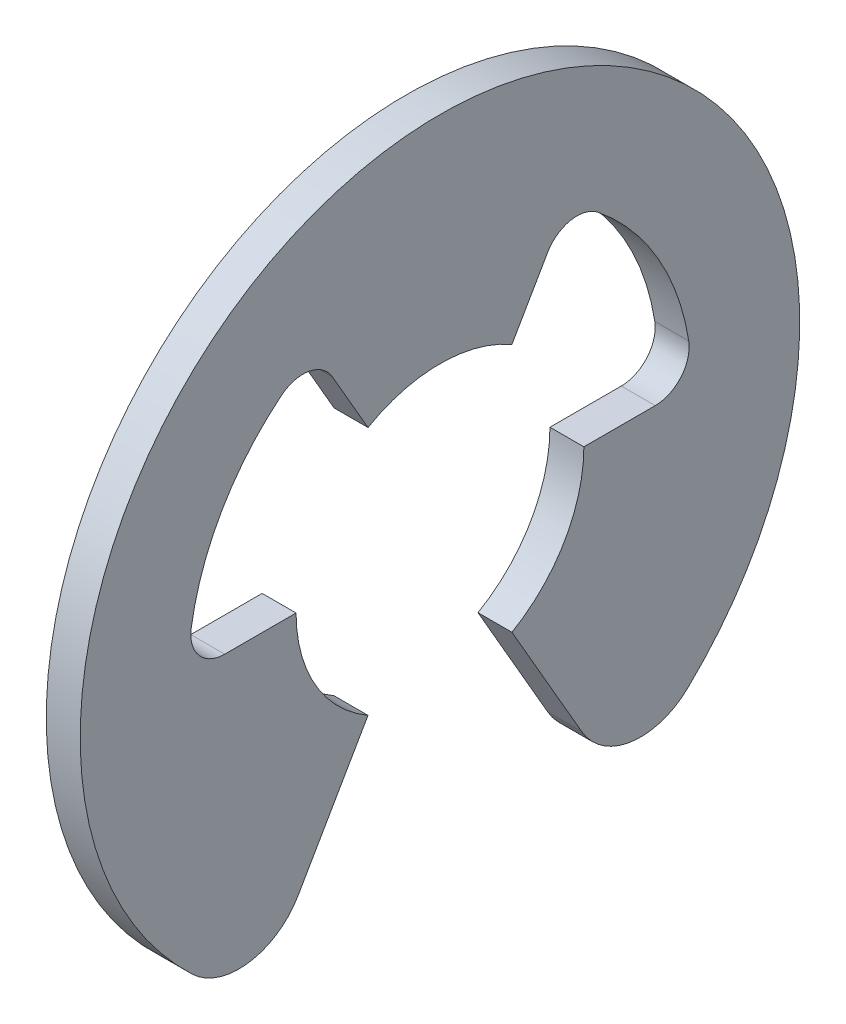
ISO-10303-21;
HEADER;
FILE_DESCRIPTION(('STEP AP214'),'2;1');
FILE_NAME('part.step','',(''),(''),'','','');
FILE_SCHEMA(('AUTOMOTIVE_DESIGN { 1 0 10303 214 1 1 1 1 }'));
ENDSEC;
DATA;
#1=APPLICATION_CONTEXT('core data for automotive mechanical design processes');
#2=APPLICATION_PROTOCOL_DEFINITION('international standard','automotive_design',2000,#1);
#3=PRODUCT_CONTEXT('',#1,'mechanical');
#4=PRODUCT('Part','Part','',(#3));
#5=PRODUCT_RELATED_PRODUCT_CATEGORY('part','',(#4));
#6=PRODUCT_DEFINITION_FORMATION('','',#4);
#7=PRODUCT_DEFINITION_CONTEXT('part definition',#1,'design');
#8=PRODUCT_DEFINITION('design','',#6,#7);
#9=PRODUCT_DEFINITION_SHAPE('','',#8);
#10=(LENGTH_UNIT() NAMED_UNIT(*) SI_UNIT(.MILLI.,.METRE.));
#11=(NAMED_UNIT(*) PLANE_ANGLE_UNIT() SI_UNIT($,.RADIAN.));
#12=(NAMED_UNIT(*) SI_UNIT($,.STERADIAN.) SOLID_ANGLE_UNIT());
#13=UNCERTAINTY_MEASURE_WITH_UNIT(LENGTH_MEASURE(1.E-05),#10,'distance_accuracy_value','');
#14=(GEOMETRIC_REPRESENTATION_CONTEXT(3) GLOBAL_UNCERTAINTY_ASSIGNED_CONTEXT((#13)) GLOBAL_UNIT_ASSIGNED_CONTEXT((#10,
#11,#12)) REPRESENTATION_CONTEXT('',''));
#15=CARTESIAN_POINT('',(0.,0.,0.));
#16=DIRECTION('',(0.,0.,1.));
#17=DIRECTION('',(1.,0.,0.));
#18=AXIS2_PLACEMENT_3D('',#15,#16,#17);
#19=CARTESIAN_POINT('',(-0.3175,-3.96469735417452,-3.75548876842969));
#20=DIRECTION('',(1.,0.,0.));
#21=DIRECTION('',(0.,0.,-1.));
#22=AXIS2_PLACEMENT_3D('',#19,#20,#21);
#23=PLANE('',#22);
#24=DIRECTION('',(0.,0.866025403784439,0.5));
#25=VECTOR('',#24,1.);
#26=CARTESIAN_POINT('',(-0.3175,-2.33168679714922,-1.3462));
#27=LINE('',#26,#25);
#28=CARTESIAN_POINT('',(-0.3175,-4.59969735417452,-2.65563650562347));
#29=VERTEX_POINT('',#28);
#30=CARTESIAN_POINT('',(-0.3175,-2.33168679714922,-1.3462));
#31=VERTEX_POINT('',#30);
#32=EDGE_CURVE('E142',#29,#31,#27,.T.);
#33=ORIENTED_EDGE('',*,*,#32,.T.);
#34=CARTESIAN_POINT('',(-0.3175,0.,0.));
#35=DIRECTION('',(1.,0.,0.));
#36=DIRECTION('',(0.,0.,-1.));
#37=AXIS2_PLACEMENT_3D('',#34,#35,#36);
#38=CIRCLE('',#37,2.6924);
#39=CARTESIAN_POINT('',(-0.3175,0.,-2.6924));
#40=VERTEX_POINT('',#39);
#41=EDGE_CURVE('E223',#31,#40,#38,.T.);
#42=ORIENTED_EDGE('',*,*,#41,.T.);
#43=DIRECTION('',(0.,0.,-1.));
#44=VECTOR('',#43,1.);
#45=CARTESIAN_POINT('',(-0.3175,0.,-4.0269415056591));
#46=LINE('',#45,#44);
#47=CARTESIAN_POINT('',(-0.3175,0.,-4.0269415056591));
#48=VERTEX_POINT('',#47);
#49=EDGE_CURVE('E162',#40,#48,#46,.T.);
#50=ORIENTED_EDGE('',*,*,#49,.T.);
#51=CARTESIAN_POINT('',(-0.3175,0.635,-4.0269415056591));
#52=DIRECTION('',(1.,0.,0.));
#53=DIRECTION('',(0.,0.,-1.));
#54=AXIS2_PLACEMENT_3D('',#51,#52,#53);
#55=CIRCLE('',#54,0.635);
#56=CARTESIAN_POINT('',(-0.3175,0.733909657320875,-4.65419096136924));
#57=VERTEX_POINT('',#56);
#58=EDGE_CURVE('E225',#48,#57,#55,.T.);
#59=ORIENTED_EDGE('',*,*,#58,.T.);
#60=CARTESIAN_POINT('',(-0.3175,0.,0.));
#61=DIRECTION('',(1.,0.,0.));
#62=DIRECTION('',(0.,0.,-1.));
#63=AXIS2_PLACEMENT_3D('',#60,#61,#62);
#64=CIRCLE('',#63,4.71170000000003);
#65=CARTESIAN_POINT('',(-0.3175,3.66369277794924,-2.96267988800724));
#66=VERTEX_POINT('',#65);
#67=EDGE_CURVE('E229',#57,#66,#64,.T.);
#68=ORIENTED_EDGE('',*,*,#67,.T.);
#69=CARTESIAN_POINT('',(-0.3175,3.16993364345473,-2.56339688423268));
#70=DIRECTION('',(1.,0.,0.));
#71=DIRECTION('',(0.,0.,-1.));
#72=AXIS2_PLACEMENT_3D('',#69,#70,#71);
#73=CIRCLE('',#72,0.635);
#74=CARTESIAN_POINT('',(-0.3175,3.48743364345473,-2.01347075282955));
#75=VERTEX_POINT('',#74);
#76=EDGE_CURVE('E233',#66,#75,#73,.T.);
#77=ORIENTED_EDGE('',*,*,#76,.T.);
#78=DIRECTION('',(0.,-0.866025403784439,0.5));
#79=VECTOR('',#78,1.);
#80=CARTESIAN_POINT('',(-0.3175,2.33168679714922,-1.3462));
#81=LINE('',#80,#79);
#82=CARTESIAN_POINT('',(-0.3175,2.33168679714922,-1.3462));
#83=VERTEX_POINT('',#82);
#84=EDGE_CURVE('E167',#75,#83,#81,.T.);
#85=ORIENTED_EDGE('',*,*,#84,.T.);
#86=CARTESIAN_POINT('',(-0.3175,0.,0.));
#87=DIRECTION('',(1.,0.,0.));
#88=DIRECTION('',(0.,0.,-1.));
#89=AXIS2_PLACEMENT_3D('',#86,#87,#88);
#90=CIRCLE('',#89,2.6924);
#91=CARTESIAN_POINT('',(-0.3175,2.33168679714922,1.3462));
#92=VERTEX_POINT('',#91);
#93=EDGE_CURVE('E236',#83,#92,#90,.T.);
#94=ORIENTED_EDGE('',*,*,#93,.T.);
#95=DIRECTION('',(0.,0.866025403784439,0.5));
#96=VECTOR('',#95,1.);
#97=CARTESIAN_POINT('',(-0.3175,3.48743364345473,2.01347075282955));
#98=LINE('',#97,#96);
#99=CARTESIAN_POINT('',(-0.3175,3.48743364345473,2.01347075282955));
#100=VERTEX_POINT('',#99);
#101=EDGE_CURVE('E172',#92,#100,#98,.T.);
#102=ORIENTED_EDGE('',*,*,#101,.T.);
#103=CARTESIAN_POINT('',(-0.3175,3.16993364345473,2.56339688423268));
#104=DIRECTION('',(1.,0.,0.));
#105=DIRECTION('',(0.,0.,-1.));
#106=AXIS2_PLACEMENT_3D('',#103,#104,#105);
#107=CIRCLE('',#106,0.635);
#108=CARTESIAN_POINT('',(-0.3175,3.66369277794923,2.96267988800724));
#109=VERTEX_POINT('',#108);
#110=EDGE_CURVE('E239',#100,#109,#107,.T.);
#111=ORIENTED_EDGE('',*,*,#110,.T.);
#112=CARTESIAN_POINT('',(-0.3175,0.,0.));
#113=DIRECTION('',(1.,0.,0.));
#114=DIRECTION('',(0.,0.,-1.));
#115=AXIS2_PLACEMENT_3D('',#112,#113,#114);
#116=CIRCLE('',#115,4.71169999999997);
#117=CARTESIAN_POINT('',(-0.3175,0.733909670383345,4.65419095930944));
#118=VERTEX_POINT('',#117);
#119=EDGE_CURVE('E243',#109,#118,#116,.T.);
#120=ORIENTED_EDGE('',*,*,#119,.T.);
#121=CARTESIAN_POINT('',(-0.3175,0.635,4.0269415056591));
#122=DIRECTION('',(1.,0.,0.));
#123=DIRECTION('',(0.,0.,-1.));
#124=AXIS2_PLACEMENT_3D('',#121,#122,#123);
#125=CIRCLE('',#124,0.635);
#126=CARTESIAN_POINT('',(-0.3175,0.,4.0269415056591));
#127=VERTEX_POINT('',#126);
#128=EDGE_CURVE('E247',#118,#127,#125,.T.);
#129=ORIENTED_EDGE('',*,*,#128,.T.);
#130=DIRECTION('',(0.,0.,-1.));
#131=VECTOR('',#130,1.);
#132=CARTESIAN_POINT('',(-0.3175,0.,2.6924));
#133=LINE('',#132,#131);
#134=CARTESIAN_POINT('',(-0.3175,0.,2.6924));
#135=VERTEX_POINT('',#134);
#136=EDGE_CURVE('E177',#127,#135,#133,.T.);
#137=ORIENTED_EDGE('',*,*,#136,.T.);
#138=CARTESIAN_POINT('',(-0.3175,0.,0.));
#139=DIRECTION('',(1.,0.,0.));
#140=DIRECTION('',(0.,0.,-1.));
#141=AXIS2_PLACEMENT_3D('',#138,#139,#140);
#142=CIRCLE('',#141,2.6924);
#143=CARTESIAN_POINT('',(-0.3175,-2.33168679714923,1.34619999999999));
#144=VERTEX_POINT('',#143);
#145=EDGE_CURVE('E250',#135,#144,#142,.T.);
#146=ORIENTED_EDGE('',*,*,#145,.T.);
#147=DIRECTION('',(0.,-0.866025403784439,0.5));
#148=VECTOR('',#147,1.);
#149=CARTESIAN_POINT('',(-0.3175,-4.59969735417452,2.65563650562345));
#150=LINE('',#149,#148);
#151=CARTESIAN_POINT('',(-0.3175,-4.59969735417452,2.65563650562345));
#152=VERTEX_POINT('',#151);
#153=EDGE_CURVE('E182',#144,#152,#150,.T.);
#154=ORIENTED_EDGE('',*,*,#153,.T.);
#155=CARTESIAN_POINT('',(-0.3175,-3.96469735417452,3.75548876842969));
#156=DIRECTION('',(1.,0.,0.));
#157=DIRECTION('',(0.,0.,-1.));
#158=AXIS2_PLACEMENT_3D('',#155,#156,#157);
#159=CIRCLE('',#158,1.27);
#160=CARTESIAN_POINT('',(-0.3175,-4.88671999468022,4.62885824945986));
#161=VERTEX_POINT('',#160);
#162=EDGE_CURVE('E253',#161,#152,#159,.T.);
#163=ORIENTED_EDGE('',*,*,#162,.F.);
#164=CARTESIAN_POINT('',(-0.3175,0.,0.));
#165=DIRECTION('',(1.,0.,0.));
#166=DIRECTION('',(0.,0.,-1.));
#167=AXIS2_PLACEMENT_3D('',#164,#165,#166);
#168=CIRCLE('',#167,6.731);
#169=CARTESIAN_POINT('',(-0.3175,-4.88671998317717,-4.62885826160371));
#170=VERTEX_POINT('',#169);
#171=EDGE_CURVE('E144',#170,#161,#168,.T.);
#172=ORIENTED_EDGE('',*,*,#171,.F.);
#173=CARTESIAN_POINT('',(-0.3175,-3.96469735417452,-3.75548876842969));
#174=DIRECTION('',(1.,0.,0.));
#175=DIRECTION('',(0.,0.,-1.));
#176=AXIS2_PLACEMENT_3D('',#173,#174,#175);
#177=CIRCLE('',#176,1.27);
#178=EDGE_CURVE('E19',#29,#170,#177,.T.);
#179=ORIENTED_EDGE('',*,*,#178,.F.);
#180=EDGE_LOOP('',(#33,#42,#50,#59,#68,#77,#85,#94,#102,#111,#120,#129,#137,#146,#154,#163,#172,#179));
#181=FACE_BOUND('',#180,.T.);
#182=ADVANCED_FACE('F16',(#181),#23,.F.);
#183=CARTESIAN_POINT('',(0.3175,-3.96469735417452,-3.75548876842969));
#184=DIRECTION('',(1.,0.,0.));
#185=DIRECTION('',(0.,0.,-1.));
#186=AXIS2_PLACEMENT_3D('',#183,#184,#185);
#187=CYLINDRICAL_SURFACE('',#186,1.27);
#188=CARTESIAN_POINT('',(0.3175,-3.96469735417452,-3.75548876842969));
#189=DIRECTION('',(1.,0.,0.));
#190=DIRECTION('',(0.,0.,-1.));
#191=AXIS2_PLACEMENT_3D('',#188,#189,#190);
#192=CIRCLE('',#191,1.27);
#193=CARTESIAN_POINT('',(0.3175,-4.59969735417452,-2.65563650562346));
#194=VERTEX_POINT('',#193);
#195=CARTESIAN_POINT('',(0.3175,-4.88671998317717,-4.62885826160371));
#196=VERTEX_POINT('',#195);
#197=EDGE_CURVE('E151',#194,#196,#192,.T.);
#198=ORIENTED_EDGE('',*,*,#197,.F.);
#199=DIRECTION('',(1.,0.,0.));
#200=VECTOR('',#199,1.);
#201=CARTESIAN_POINT('',(0.3175,-4.59969735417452,-2.65563650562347));
#202=LINE('',#201,#200);
#203=EDGE_CURVE('E148',#194,#29,#202,.F.);
#204=ORIENTED_EDGE('',*,*,#203,.T.);
#205=ORIENTED_EDGE('',*,*,#178,.T.);
#206=DIRECTION('',(1.,0.,0.));
#207=VECTOR('',#206,1.);
#208=CARTESIAN_POINT('',(0.3175,-4.88671997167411,-4.62885827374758));
#209=LINE('',#208,#207);
#210=EDGE_CURVE('E160',#196,#170,#209,.F.);
#211=ORIENTED_EDGE('',*,*,#210,.F.);
#212=EDGE_LOOP('',(#198,#204,#205,#211));
#213=FACE_BOUND('',#212,.T.);
#214=ADVANCED_FACE('F149',(#213),#187,.T.);
#215=CARTESIAN_POINT('',(0.3175,0.,0.));
#216=DIRECTION('',(1.,0.,0.));
#217=DIRECTION('',(0.,0.,-1.));
#218=AXIS2_PLACEMENT_3D('',#215,#216,#217);
#219=CYLINDRICAL_SURFACE('',#218,6.731);
#220=CARTESIAN_POINT('',(0.3175,0.,0.));
#221=DIRECTION('',(1.,0.,0.));
#222=DIRECTION('',(0.,0.,-1.));
#223=AXIS2_PLACEMENT_3D('',#220,#221,#222);
#224=CIRCLE('',#223,6.731);
#225=CARTESIAN_POINT('',(0.3175,-4.88671999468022,4.62885824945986));
#226=VERTEX_POINT('',#225);
#227=EDGE_CURVE('E156',#196,#226,#224,.T.);
#228=ORIENTED_EDGE('',*,*,#227,.F.);
#229=ORIENTED_EDGE('',*,*,#210,.T.);
#230=ORIENTED_EDGE('',*,*,#171,.T.);
#231=DIRECTION('',(1.,0.,0.));
#232=VECTOR('',#231,1.);
#233=CARTESIAN_POINT('',(0.3175,-4.88671999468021,4.62885824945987));
#234=LINE('',#233,#232);
#235=EDGE_CURVE('E254',#226,#161,#234,.F.);
#236=ORIENTED_EDGE('',*,*,#235,.F.);
#237=EDGE_LOOP('',(#228,#229,#230,#236));
#238=FACE_BOUND('',#237,.T.);
#239=ADVANCED_FACE('F258',(#238),#219,.T.);
#240=CARTESIAN_POINT('',(0.3175,-3.96469735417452,3.75548876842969));
#241=DIRECTION('',(1.,0.,0.));
#242=DIRECTION('',(0.,0.,-1.));
#243=AXIS2_PLACEMENT_3D('',#240,#241,#242);
#244=CYLINDRICAL_SURFACE('',#243,1.27);
#245=CARTESIAN_POINT('',(0.3175,-3.96469735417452,3.75548876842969));
#246=DIRECTION('',(1.,0.,0.));
#247=DIRECTION('',(0.,0.,-1.));
#248=AXIS2_PLACEMENT_3D('',#245,#246,#247);
#249=CIRCLE('',#248,1.27);
#250=CARTESIAN_POINT('',(0.3175,-4.59969735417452,2.65563650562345));
#251=VERTEX_POINT('',#250);
#252=EDGE_CURVE('E218',#226,#251,#249,.T.);
#253=ORIENTED_EDGE('',*,*,#252,.F.);
#254=ORIENTED_EDGE('',*,*,#235,.T.);
#255=ORIENTED_EDGE('',*,*,#162,.T.);
#256=DIRECTION('',(1.,0.,0.));
#257=VECTOR('',#256,1.);
#258=CARTESIAN_POINT('',(0.3175,-4.59969735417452,2.65563650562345));
#259=LINE('',#258,#257);
#260=EDGE_CURVE('E186',#152,#251,#259,.T.);
#261=ORIENTED_EDGE('',*,*,#260,.T.);
#262=EDGE_LOOP('',(#253,#254,#255,#261));
#263=FACE_BOUND('',#262,.T.);
#264=ADVANCED_FACE('F283',(#263),#244,.T.);
#265=CARTESIAN_POINT('',(0.3175,-4.59969735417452,2.65563650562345));
#266=DIRECTION('',(0.,0.5,0.866025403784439));
#267=DIRECTION('',(0.,-0.866025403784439,0.5));
#268=AXIS2_PLACEMENT_3D('',#265,#266,#267);
#269=PLANE('',#268);
#270=DIRECTION('',(1.,0.,0.));
#271=VECTOR('',#270,1.);
#272=CARTESIAN_POINT('',(0.3175,-2.33168679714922,1.3462));
#273=LINE('',#272,#271);
#274=CARTESIAN_POINT('',(0.3175,-2.33168679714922,1.3462));
#275=VERTEX_POINT('',#274);
#276=EDGE_CURVE('E185',#144,#275,#273,.T.);
#277=ORIENTED_EDGE('',*,*,#276,.T.);
#278=DIRECTION('',(0.,0.866025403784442,-0.499999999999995));
#279=VECTOR('',#278,1.);
#280=CARTESIAN_POINT('',(0.3175,-4.59969735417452,2.65563650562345));
#281=LINE('',#280,#279);
#282=EDGE_CURVE('E217',#251,#275,#281,.T.);
#283=ORIENTED_EDGE('',*,*,#282,.F.);
#284=ORIENTED_EDGE('',*,*,#260,.F.);
#285=ORIENTED_EDGE('',*,*,#153,.F.);
#286=EDGE_LOOP('',(#277,#283,#284,#285));
#287=FACE_BOUND('',#286,.T.);
#288=ADVANCED_FACE('F446',(#287),#269,.F.);
#289=CARTESIAN_POINT('',(0.3175,0.,0.));
#290=DIRECTION('',(1.,0.,0.));
#291=DIRECTION('',(0.,0.,-1.));
#292=AXIS2_PLACEMENT_3D('',#289,#290,#291);
#293=CYLINDRICAL_SURFACE('',#292,2.6924);
#294=DIRECTION('',(1.,0.,0.));
#295=VECTOR('',#294,1.);
#296=CARTESIAN_POINT('',(0.3175,0.,2.6924));
#297=LINE('',#296,#295);
#298=CARTESIAN_POINT('',(0.3175,0.,2.6924));
#299=VERTEX_POINT('',#298);
#300=EDGE_CURVE('E181',#135,#299,#297,.T.);
#301=ORIENTED_EDGE('',*,*,#300,.T.);
#302=CARTESIAN_POINT('',(0.3175,0.,0.));
#303=DIRECTION('',(1.,0.,0.));
#304=DIRECTION('',(0.,0.,-1.));
#305=AXIS2_PLACEMENT_3D('',#302,#303,#304);
#306=CIRCLE('',#305,2.6924);
#307=EDGE_CURVE('E214',#275,#299,#306,.F.);
#308=ORIENTED_EDGE('',*,*,#307,.F.);
#309=ORIENTED_EDGE('',*,*,#276,.F.);
#310=ORIENTED_EDGE('',*,*,#145,.F.);
#311=EDGE_LOOP('',(#301,#308,#309,#310));
#312=FACE_BOUND('',#311,.T.);
#313=ADVANCED_FACE('F436',(#312),#293,.F.);
#314=CARTESIAN_POINT('',(0.3175,0.,2.6924));
#315=DIRECTION('',(0.,-1.,0.));
#316=DIRECTION('',(0.,0.,-1.));
#317=AXIS2_PLACEMENT_3D('',#314,#315,#316);
#318=PLANE('',#317);
#319=DIRECTION('',(1.,0.,0.));
#320=VECTOR('',#319,1.);
#321=CARTESIAN_POINT('',(0.3175,0.,4.0269415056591));
#322=LINE('',#321,#320);
#323=CARTESIAN_POINT('',(0.3175,0.,4.0269415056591));
#324=VERTEX_POINT('',#323);
#325=EDGE_CURVE('E180',#127,#324,#322,.T.);
#326=ORIENTED_EDGE('',*,*,#325,.T.);
#327=DIRECTION('',(0.,0.,-1.));
#328=VECTOR('',#327,1.);
#329=CARTESIAN_POINT('',(0.3175,0.,-3.75548876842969));
#330=LINE('',#329,#328);
#331=EDGE_CURVE('E213',#299,#324,#330,.F.);
#332=ORIENTED_EDGE('',*,*,#331,.F.);
#333=ORIENTED_EDGE('',*,*,#300,.F.);
#334=ORIENTED_EDGE('',*,*,#136,.F.);
#335=EDGE_LOOP('',(#326,#332,#333,#334));
#336=FACE_BOUND('',#335,.T.);
#337=ADVANCED_FACE('F426',(#336),#318,.F.);
#338=CARTESIAN_POINT('',(0.3175,0.635,4.0269415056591));
#339=DIRECTION('',(1.,0.,0.));
#340=DIRECTION('',(0.,0.,-1.));
#341=AXIS2_PLACEMENT_3D('',#338,#339,#340);
#342=CYLINDRICAL_SURFACE('',#341,0.635);
#343=DIRECTION('',(1.,0.,0.));
#344=VECTOR('',#343,1.);
#345=CARTESIAN_POINT('',(0.3175,0.733909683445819,4.65419095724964));
#346=LINE('',#345,#344);
#347=CARTESIAN_POINT('',(0.3175,0.733909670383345,4.65419095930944));
#348=VERTEX_POINT('',#347);
#349=EDGE_CURVE('E246',#118,#348,#346,.T.);
#350=ORIENTED_EDGE('',*,*,#349,.T.);
#351=CARTESIAN_POINT('',(0.3175,0.635,4.0269415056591));
#352=DIRECTION('',(1.,0.,0.));
#353=DIRECTION('',(0.,0.,-1.));
#354=AXIS2_PLACEMENT_3D('',#351,#352,#353);
#355=CIRCLE('',#354,0.635);
#356=EDGE_CURVE('E210',#324,#348,#355,.F.);
#357=ORIENTED_EDGE('',*,*,#356,.F.);
#358=ORIENTED_EDGE('',*,*,#325,.F.);
#359=ORIENTED_EDGE('',*,*,#128,.F.);
#360=EDGE_LOOP('',(#350,#357,#358,#359));
#361=FACE_BOUND('',#360,.T.);
#362=ADVANCED_FACE('F416',(#361),#342,.F.);
#363=CARTESIAN_POINT('',(0.3175,0.,0.));
#364=DIRECTION('',(1.,0.,0.));
#365=DIRECTION('',(0.,0.,-1.));
#366=AXIS2_PLACEMENT_3D('',#363,#364,#365);
#367=CYLINDRICAL_SURFACE('',#366,4.71169999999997);
#368=DIRECTION('',(1.,0.,0.));
#369=VECTOR('',#368,1.);
#370=CARTESIAN_POINT('',(0.3175,3.66369277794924,2.96267988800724));
#371=LINE('',#370,#369);
#372=CARTESIAN_POINT('',(0.3175,3.66369277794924,2.96267988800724));
#373=VERTEX_POINT('',#372);
#374=EDGE_CURVE('E242',#109,#373,#371,.T.);
#375=ORIENTED_EDGE('',*,*,#374,.T.);
#376=CARTESIAN_POINT('',(0.3175,0.,0.));
#377=DIRECTION('',(1.,0.,0.));
#378=DIRECTION('',(0.,0.,-1.));
#379=AXIS2_PLACEMENT_3D('',#376,#377,#378);
#380=CIRCLE('',#379,4.71169999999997);
#381=EDGE_CURVE('E207',#348,#373,#380,.F.);
#382=ORIENTED_EDGE('',*,*,#381,.F.);
#383=ORIENTED_EDGE('',*,*,#349,.F.);
#384=ORIENTED_EDGE('',*,*,#119,.F.);
#385=EDGE_LOOP('',(#375,#382,#383,#384));
#386=FACE_BOUND('',#385,.T.);
#387=ADVANCED_FACE('F406',(#386),#367,.F.);
#388=CARTESIAN_POINT('',(0.3175,3.16993364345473,2.56339688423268));
#389=DIRECTION('',(1.,0.,0.));
#390=DIRECTION('',(0.,0.,-1.));
#391=AXIS2_PLACEMENT_3D('',#388,#389,#390);
#392=CYLINDRICAL_SURFACE('',#391,0.635);
#393=DIRECTION('',(1.,0.,0.));
#394=VECTOR('',#393,1.);
#395=CARTESIAN_POINT('',(0.3175,3.48743364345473,2.01347075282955));
#396=LINE('',#395,#394);
#397=CARTESIAN_POINT('',(0.3175,3.48743364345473,2.01347075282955));
#398=VERTEX_POINT('',#397);
#399=EDGE_CURVE('E176',#100,#398,#396,.T.);
#400=ORIENTED_EDGE('',*,*,#399,.T.);
#401=CARTESIAN_POINT('',(0.3175,3.16993364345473,2.56339688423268));
#402=DIRECTION('',(1.,0.,0.));
#403=DIRECTION('',(0.,0.,-1.));
#404=AXIS2_PLACEMENT_3D('',#401,#402,#403);
#405=CIRCLE('',#404,0.635);
#406=EDGE_CURVE('E204',#373,#398,#405,.F.);
#407=ORIENTED_EDGE('',*,*,#406,.F.);
#408=ORIENTED_EDGE('',*,*,#374,.F.);
#409=ORIENTED_EDGE('',*,*,#110,.F.);
#410=EDGE_LOOP('',(#400,#407,#408,#409));
#411=FACE_BOUND('',#410,.T.);
#412=ADVANCED_FACE('F396',(#411),#392,.F.);
#413=CARTESIAN_POINT('',(0.3175,3.48743364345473,2.01347075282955));
#414=DIRECTION('',(0.,0.5,-0.866025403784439));
#415=DIRECTION('',(0.,0.866025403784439,0.5));
#416=AXIS2_PLACEMENT_3D('',#413,#414,#415);
#417=PLANE('',#416);
#418=DIRECTION('',(1.,0.,0.));
#419=VECTOR('',#418,1.);
#420=CARTESIAN_POINT('',(0.3175,2.33168679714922,1.3462));
#421=LINE('',#420,#419);
#422=CARTESIAN_POINT('',(0.3175,2.33168679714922,1.3462));
#423=VERTEX_POINT('',#422);
#424=EDGE_CURVE('E175',#92,#423,#421,.T.);
#425=ORIENTED_EDGE('',*,*,#424,.T.);
#426=DIRECTION('',(0.,-0.866025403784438,-0.500000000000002));
#427=VECTOR('',#426,1.);
#428=CARTESIAN_POINT('',(0.3175,3.48743364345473,2.01347075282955));
#429=LINE('',#428,#427);
#430=EDGE_CURVE('E203',#398,#423,#429,.T.);
#431=ORIENTED_EDGE('',*,*,#430,.F.);
#432=ORIENTED_EDGE('',*,*,#399,.F.);
#433=ORIENTED_EDGE('',*,*,#101,.F.);
#434=EDGE_LOOP('',(#425,#431,#432,#433));
#435=FACE_BOUND('',#434,.T.);
#436=ADVANCED_FACE('F386',(#435),#417,.F.);
#437=CARTESIAN_POINT('',(0.3175,0.,0.));
#438=DIRECTION('',(1.,0.,0.));
#439=DIRECTION('',(0.,0.,-1.));
#440=AXIS2_PLACEMENT_3D('',#437,#438,#439);
#441=CYLINDRICAL_SURFACE('',#440,2.6924);
#442=DIRECTION('',(1.,0.,0.));
#443=VECTOR('',#442,1.);
#444=CARTESIAN_POINT('',(0.3175,2.33168679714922,-1.3462));
#445=LINE('',#444,#443);
#446=CARTESIAN_POINT('',(0.3175,2.33168679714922,-1.3462));
#447=VERTEX_POINT('',#446);
#448=EDGE_CURVE('E171',#83,#447,#445,.T.);
#449=ORIENTED_EDGE('',*,*,#448,.T.);
#450=CARTESIAN_POINT('',(0.3175,0.,0.));
#451=DIRECTION('',(1.,0.,0.));
#452=DIRECTION('',(0.,0.,-1.));
#453=AXIS2_PLACEMENT_3D('',#450,#451,#452);
#454=CIRCLE('',#453,2.6924);
#455=EDGE_CURVE('E200',#423,#447,#454,.F.);
#456=ORIENTED_EDGE('',*,*,#455,.F.);
#457=ORIENTED_EDGE('',*,*,#424,.F.);
#458=ORIENTED_EDGE('',*,*,#93,.F.);
#459=EDGE_LOOP('',(#449,#456,#457,#458));
#460=FACE_BOUND('',#459,.T.);
#461=ADVANCED_FACE('F377',(#460),#441,.F.);
#462=CARTESIAN_POINT('',(0.3175,2.33168679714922,-1.3462));
#463=DIRECTION('',(0.,0.5,0.866025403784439));
#464=DIRECTION('',(0.,-0.866025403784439,0.5));
#465=AXIS2_PLACEMENT_3D('',#462,#463,#464);
#466=PLANE('',#465);
#467=DIRECTION('',(1.,0.,0.));
#468=VECTOR('',#467,1.);
#469=CARTESIAN_POINT('',(0.3175,3.48743364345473,-2.01347075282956));
#470=LINE('',#469,#468);
#471=CARTESIAN_POINT('',(0.3175,3.48743364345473,-2.01347075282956));
#472=VERTEX_POINT('',#471);
#473=EDGE_CURVE('E170',#75,#472,#470,.T.);
#474=ORIENTED_EDGE('',*,*,#473,.T.);
#475=DIRECTION('',(0.,0.866025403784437,-0.500000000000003));
#476=VECTOR('',#475,1.);
#477=CARTESIAN_POINT('',(0.3175,2.33168679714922,-1.3462));
#478=LINE('',#477,#476);
#479=EDGE_CURVE('E199',#447,#472,#478,.T.);
#480=ORIENTED_EDGE('',*,*,#479,.F.);
#481=ORIENTED_EDGE('',*,*,#448,.F.);
#482=ORIENTED_EDGE('',*,*,#84,.F.);
#483=EDGE_LOOP('',(#474,#480,#481,#482));
#484=FACE_BOUND('',#483,.T.);
#485=ADVANCED_FACE('F302',(#484),#466,.F.);
#486=CARTESIAN_POINT('',(0.3175,3.16993364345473,-2.56339688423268));
#487=DIRECTION('',(1.,0.,0.));
#488=DIRECTION('',(0.,0.,-1.));
#489=AXIS2_PLACEMENT_3D('',#486,#487,#488);
#490=CYLINDRICAL_SURFACE('',#489,0.635);
#491=DIRECTION('',(1.,0.,0.));
#492=VECTOR('',#491,1.);
#493=CARTESIAN_POINT('',(0.3175,3.66369277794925,-2.96267988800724));
#494=LINE('',#493,#492);
#495=CARTESIAN_POINT('',(0.3175,3.66369277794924,-2.96267988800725));
#496=VERTEX_POINT('',#495);
#497=EDGE_CURVE('E232',#66,#496,#494,.T.);
#498=ORIENTED_EDGE('',*,*,#497,.T.);
#499=CARTESIAN_POINT('',(0.3175,3.16993364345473,-2.56339688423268));
#500=DIRECTION('',(1.,0.,0.));
#501=DIRECTION('',(0.,0.,-1.));
#502=AXIS2_PLACEMENT_3D('',#499,#500,#501);
#503=CIRCLE('',#502,0.635);
#504=EDGE_CURVE('E196',#472,#496,#503,.F.);
#505=ORIENTED_EDGE('',*,*,#504,.F.);
#506=ORIENTED_EDGE('',*,*,#473,.F.);
#507=ORIENTED_EDGE('',*,*,#76,.F.);
#508=EDGE_LOOP('',(#498,#505,#506,#507));
#509=FACE_BOUND('',#508,.T.);
#510=ADVANCED_FACE('F305',(#509),#490,.F.);
#511=CARTESIAN_POINT('',(0.3175,0.,0.));
#512=DIRECTION('',(1.,0.,0.));
#513=DIRECTION('',(0.,0.,-1.));
#514=AXIS2_PLACEMENT_3D('',#511,#512,#513);
#515=CYLINDRICAL_SURFACE('',#514,4.71170000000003);
#516=DIRECTION('',(1.,0.,0.));
#517=VECTOR('',#516,1.);
#518=CARTESIAN_POINT('',(0.3175,0.733909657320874,-4.65419096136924));
#519=LINE('',#518,#517);
#520=CARTESIAN_POINT('',(0.3175,0.733909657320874,-4.65419096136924));
#521=VERTEX_POINT('',#520);
#522=EDGE_CURVE('E228',#57,#521,#519,.T.);
#523=ORIENTED_EDGE('',*,*,#522,.T.);
#524=CARTESIAN_POINT('',(0.3175,0.,0.));
#525=DIRECTION('',(1.,0.,0.));
#526=DIRECTION('',(0.,0.,-1.));
#527=AXIS2_PLACEMENT_3D('',#524,#525,#526);
#528=CIRCLE('',#527,4.71170000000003);
#529=EDGE_CURVE('E193',#496,#521,#528,.F.);
#530=ORIENTED_EDGE('',*,*,#529,.F.);
#531=ORIENTED_EDGE('',*,*,#497,.F.);
#532=ORIENTED_EDGE('',*,*,#67,.F.);
#533=EDGE_LOOP('',(#523,#530,#531,#532));
#534=FACE_BOUND('',#533,.T.);
#535=ADVANCED_FACE('F309',(#534),#515,.F.);
#536=CARTESIAN_POINT('',(0.3175,0.635,-4.0269415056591));
#537=DIRECTION('',(1.,0.,0.));
#538=DIRECTION('',(0.,0.,-1.));
#539=AXIS2_PLACEMENT_3D('',#536,#537,#538);
#540=CYLINDRICAL_SURFACE('',#539,0.635);
#541=DIRECTION('',(1.,0.,0.));
#542=VECTOR('',#541,1.);
#543=CARTESIAN_POINT('',(0.3175,0.,-4.0269415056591));
#544=LINE('',#543,#542);
#545=CARTESIAN_POINT('',(0.3175,0.,-4.0269415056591));
#546=VERTEX_POINT('',#545);
#547=EDGE_CURVE('E166',#48,#546,#544,.T.);
#548=ORIENTED_EDGE('',*,*,#547,.T.);
#549=CARTESIAN_POINT('',(0.3175,0.635,-4.0269415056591));
#550=DIRECTION('',(1.,0.,0.));
#551=DIRECTION('',(0.,0.,-1.));
#552=AXIS2_PLACEMENT_3D('',#549,#550,#551);
#553=CIRCLE('',#552,0.635);
#554=EDGE_CURVE('E190',#521,#546,#553,.F.);
#555=ORIENTED_EDGE('',*,*,#554,.F.);
#556=ORIENTED_EDGE('',*,*,#522,.F.);
#557=ORIENTED_EDGE('',*,*,#58,.F.);
#558=EDGE_LOOP('',(#548,#555,#556,#557));
#559=FACE_BOUND('',#558,.T.);
#560=ADVANCED_FACE('F313',(#559),#540,.F.);
#561=CARTESIAN_POINT('',(0.3175,0.,-4.0269415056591));
#562=DIRECTION('',(0.,-1.,0.));
#563=DIRECTION('',(0.,0.,-1.));
#564=AXIS2_PLACEMENT_3D('',#561,#562,#563);
#565=PLANE('',#564);
#566=DIRECTION('',(1.,0.,0.));
#567=VECTOR('',#566,1.);
#568=CARTESIAN_POINT('',(0.3175,0.,-2.6924));
#569=LINE('',#568,#567);
#570=CARTESIAN_POINT('',(0.3175,0.,-2.6924));
#571=VERTEX_POINT('',#570);
#572=EDGE_CURVE('E165',#40,#571,#569,.T.);
#573=ORIENTED_EDGE('',*,*,#572,.T.);
#574=DIRECTION('',(0.,0.,-1.));
#575=VECTOR('',#574,1.);
#576=CARTESIAN_POINT('',(0.3175,0.,-3.75548876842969));
#577=LINE('',#576,#575);
#578=EDGE_CURVE('E189',#546,#571,#577,.F.);
#579=ORIENTED_EDGE('',*,*,#578,.F.);
#580=ORIENTED_EDGE('',*,*,#547,.F.);
#581=ORIENTED_EDGE('',*,*,#49,.F.);
#582=EDGE_LOOP('',(#573,#579,#580,#581));
#583=FACE_BOUND('',#582,.T.);
#584=ADVANCED_FACE('F315',(#583),#565,.F.);
#585=CARTESIAN_POINT('',(0.3175,0.,0.));
#586=DIRECTION('',(1.,0.,0.));
#587=DIRECTION('',(0.,0.,-1.));
#588=AXIS2_PLACEMENT_3D('',#585,#586,#587);
#589=CYLINDRICAL_SURFACE('',#588,2.6924);
#590=DIRECTION('',(1.,0.,0.));
#591=VECTOR('',#590,1.);
#592=CARTESIAN_POINT('',(0.3175,-2.33168679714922,-1.3462));
#593=LINE('',#592,#591);
#594=CARTESIAN_POINT('',(0.3175,-2.33168679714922,-1.3462));
#595=VERTEX_POINT('',#594);
#596=EDGE_CURVE('E34',#31,#595,#593,.T.);
#597=ORIENTED_EDGE('',*,*,#596,.T.);
#598=CARTESIAN_POINT('',(0.3175,0.,0.));
#599=DIRECTION('',(1.,0.,0.));
#600=DIRECTION('',(0.,0.,-1.));
#601=AXIS2_PLACEMENT_3D('',#598,#599,#600);
#602=CIRCLE('',#601,2.6924);
#603=EDGE_CURVE('E25',#571,#595,#602,.F.);
#604=ORIENTED_EDGE('',*,*,#603,.F.);
#605=ORIENTED_EDGE('',*,*,#572,.F.);
#606=ORIENTED_EDGE('',*,*,#41,.F.);
#607=EDGE_LOOP('',(#597,#604,#605,#606));
#608=FACE_BOUND('',#607,.T.);
#609=ADVANCED_FACE('F265',(#608),#589,.F.);
#610=CARTESIAN_POINT('',(0.3175,-2.33168679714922,-1.3462));
#611=DIRECTION('',(0.,0.5,-0.866025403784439));
#612=DIRECTION('',(0.,0.866025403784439,0.5));
#613=AXIS2_PLACEMENT_3D('',#610,#611,#612);
#614=PLANE('',#613);
#615=ORIENTED_EDGE('',*,*,#203,.F.);
#616=DIRECTION('',(0.,-0.866025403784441,-0.499999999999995));
#617=VECTOR('',#616,1.);
#618=CARTESIAN_POINT('',(0.3175,-2.33168679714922,-1.3462));
#619=LINE('',#618,#617);
#620=EDGE_CURVE('E11',#595,#194,#619,.T.);
#621=ORIENTED_EDGE('',*,*,#620,.F.);
#622=ORIENTED_EDGE('',*,*,#596,.F.);
#623=ORIENTED_EDGE('',*,*,#32,.F.);
#624=EDGE_LOOP('',(#615,#621,#622,#623));
#625=FACE_BOUND('',#624,.T.);
#626=ADVANCED_FACE('F154',(#625),#614,.F.);
#627=CARTESIAN_POINT('',(0.3175,-3.96469735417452,-3.75548876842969));
#628=DIRECTION('',(1.,0.,0.));
#629=DIRECTION('',(0.,0.,-1.));
#630=AXIS2_PLACEMENT_3D('',#627,#628,#629);
#631=PLANE('',#630);
#632=ORIENTED_EDGE('',*,*,#603,.T.);
#633=ORIENTED_EDGE('',*,*,#620,.T.);
#634=ORIENTED_EDGE('',*,*,#197,.T.);
#635=ORIENTED_EDGE('',*,*,#227,.T.);
#636=ORIENTED_EDGE('',*,*,#252,.T.);
#637=ORIENTED_EDGE('',*,*,#282,.T.);
#638=ORIENTED_EDGE('',*,*,#307,.T.);
#639=ORIENTED_EDGE('',*,*,#331,.T.);
#640=ORIENTED_EDGE('',*,*,#356,.T.);
#641=ORIENTED_EDGE('',*,*,#381,.T.);
#642=ORIENTED_EDGE('',*,*,#406,.T.);
#643=ORIENTED_EDGE('',*,*,#430,.T.);
#644=ORIENTED_EDGE('',*,*,#455,.T.);
#645=ORIENTED_EDGE('',*,*,#479,.T.);
#646=ORIENTED_EDGE('',*,*,#504,.T.);
#647=ORIENTED_EDGE('',*,*,#529,.T.);
#648=ORIENTED_EDGE('',*,*,#554,.T.);
#649=ORIENTED_EDGE('',*,*,#578,.T.);
#650=EDGE_LOOP('',(#632,#633,#634,#635,#636,#637,#638,#639,#640,#641,#642,#643,#644,#645,#646,
#647,#648,#649));
#651=FACE_BOUND('',#650,.T.);
#652=ADVANCED_FACE('F261',(#651),#631,.T.);
#653=CLOSED_SHELL('',(#182,#214,#239,#264,#288,#313,#337,#362,#387,#412,#436,#461,#485,#510,
#535,#560,#584,#609,#626,#652));
#654=MANIFOLD_SOLID_BREP('B1',#653);
#655=ADVANCED_BREP_SHAPE_REPRESENTATION('',(#18,#654),#14);
#656=SHAPE_DEFINITION_REPRESENTATION(#9,#655);
ENDSEC;
END-ISO-10303-21;
